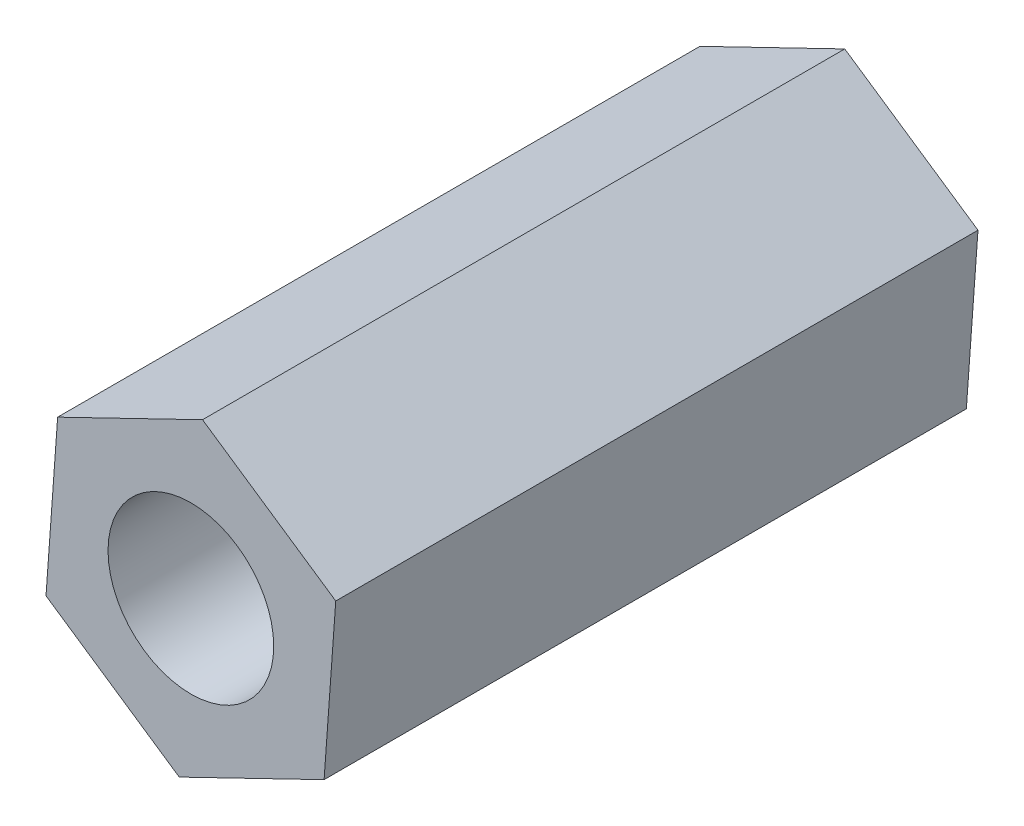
from build123d import *

# Parameters (mm, degrees)
SKETCH1_R           = 1.29
BOSS_EXTRUDE1_DEPTH = 10


with BuildPart() as part:
    # Sketch1 → Boss-Extrude1 (new body)
    with BuildSketch(Plane.XY):
        Polygon((-37.295698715, -2.5), (-35.039961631, -1.407051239), (-34.85861448, 1.092948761), (-36.933004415, 2.5), (-39.188741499, 1.407051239), (-39.37008865, -1.092948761), align=None)
        with Locations((-37.114351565, 0)):
            Circle(SKETCH1_R, mode=Mode.SUBTRACT)
    extrude(amount=BOSS_EXTRUDE1_DEPTH)


solid = part.part
